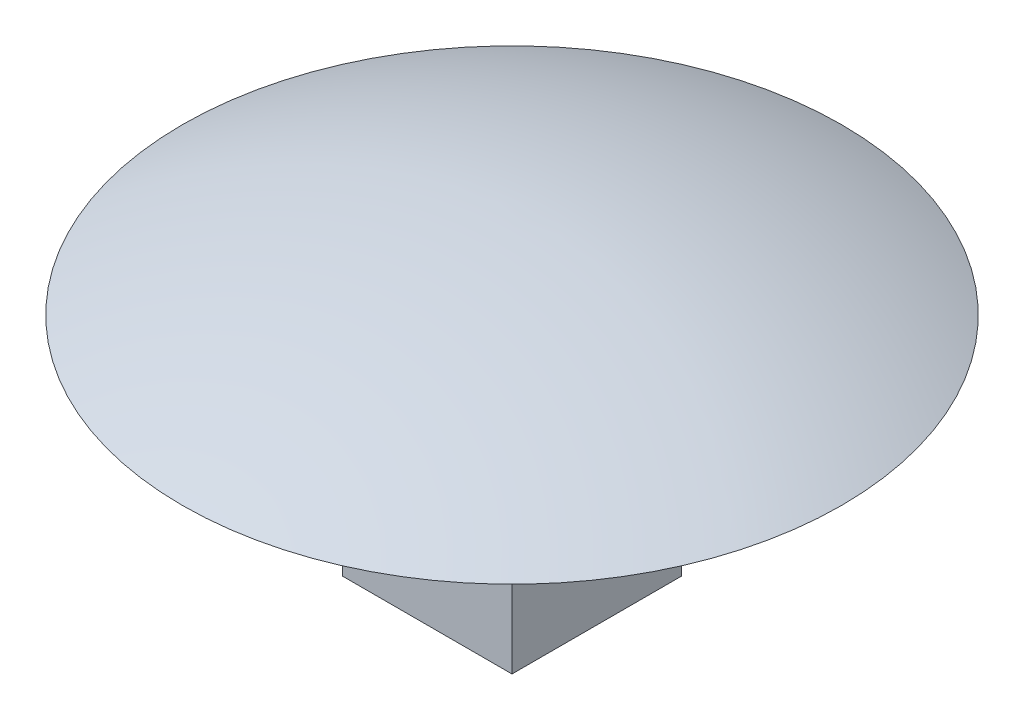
from build123d import *

# Parameters (mm, degrees)
SKETCH2_W      = 4.5
SKETCH2_H      = 4.5
EXTRUDE1_DEPTH = 6


with BuildPart() as part:
    # Sketch1 → Revolve1 (revolve)
    with BuildSketch(Plane.XY):
        with BuildLine():
            Line((0, 0), (0, 2))
            ThreePointArc((0, 2), (4.487830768, 1.493634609), (8.75, 0))
            Line((8.75, 0), (0, 0))
        make_face()
    revolve(axis=Axis((0, 0, 0), (0, 1, 0)))

    # Sketch2 → Extrude1 (add)
    with BuildSketch(Plane.XZ):
        Rectangle(SKETCH2_W, SKETCH2_H)
    extrude(amount=EXTRUDE1_DEPTH)


solid = part.part
